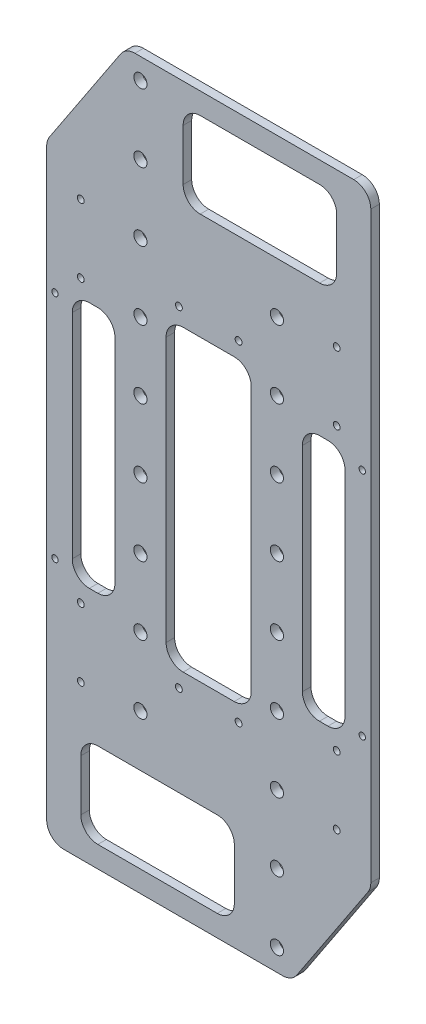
from build123d import *

# Parameters (mm, degrees)
SKETCH1_W                      = 114.3
SKETCH1_H                      = 63.5
SKETCH1_W_2                    = 63.363323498
SKETCH1_H_2                    = 222.25
SKETCH1_W_3                    = 31.75
SKETCH1_H_3                    = 184.15
BOSS_EXTRUDE1_DEPTH            = 6.35
SKETCH4_R                      = 4.9022
CUT_EXTRUDE2_DEPTH             = 592.266500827
F_1_4_20_TAPPED_HOLE1_D        = 5.1054
FILLET1_R                      = 12.7
F_1_4_20_TAPPED_HOLE2_D        = 5.1054
F_3_16_0_1875_DIAMETER_HOLE1_D = 4.7625


with BuildPart() as part:
    # Sketch1 → Boss-Extrude1 (new body)
    with BuildSketch(Plane.XY):
        Polygon((0, 0), (0, 450.85), (58.8772, 539.75), (241.3, 539.75), (241.3, 88.9), (182.4228, 0), align=None)
        with Locations((158.75, 492.125)):
            Rectangle(SKETCH1_W, SKETCH1_H, mode=Mode.SUBTRACT)
        with Locations((82.55, 47.625)):
            Rectangle(SKETCH1_W, SKETCH1_H, mode=Mode.SUBTRACT)
        with Locations((120.581661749, 269.875)):
            Rectangle(SKETCH1_W_2, SKETCH1_H_2, mode=Mode.SUBTRACT)
        with Locations((206.238323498, 269.875)):
            Rectangle(SKETCH1_W_3, SKETCH1_H_3, mode=Mode.SUBTRACT)
        with Locations((34.925, 269.875)):
            Rectangle(SKETCH1_W_3, SKETCH1_H_3, mode=Mode.SUBTRACT)
    extrude(amount=BOSS_EXTRUDE1_DEPTH)

    # Sketch4 → Cut-Extrude2 (cut, through all)
    with BuildSketch(Plane.XY):
        with Locations((69.781661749, 524.1544)):
            Circle(SKETCH4_R)
        with Locations((171.381661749, 422.5544)):
            Circle(SKETCH4_R)
        with Locations((171.381661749, 371.7544)):
            Circle(SKETCH4_R)
        with Locations((171.381661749, 320.9544)):
            Circle(SKETCH4_R)
        with Locations((171.381661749, 270.1544)):
            Circle(SKETCH4_R)
        with Locations((171.381661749, 219.3544)):
            Circle(SKETCH4_R)
        with Locations((171.381661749, 168.5544)):
            Circle(SKETCH4_R)
        with Locations((171.381661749, 117.7544)):
            Circle(SKETCH4_R)
        with Locations((171.381661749, 66.9544)):
            Circle(SKETCH4_R)
        with Locations((171.381661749, 16.1544)):
            Circle(SKETCH4_R)
        with Locations((69.781661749, 473.3544)):
            Circle(SKETCH4_R)
        with Locations((69.781661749, 422.5544)):
            Circle(SKETCH4_R)
        with Locations((69.781661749, 371.7544)):
            Circle(SKETCH4_R)
        with Locations((69.781661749, 320.9544)):
            Circle(SKETCH4_R)
        with Locations((69.781661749, 270.1544)):
            Circle(SKETCH4_R)
        with Locations((69.781661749, 219.3544)):
            Circle(SKETCH4_R)
        with Locations((69.781661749, 168.5544)):
            Circle(SKETCH4_R)
        with Locations((69.781661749, 117.7544)):
            Circle(SKETCH4_R)
    extrude(amount=CUT_EXTRUDE2_DEPTH, mode=Mode.SUBTRACT)

    # 1_4-20 Tapped Hole1 (through all)
    with Locations(Plane.XY.offset(6.35)):
        with Locations((98.425, 146.84375), (142.875, 146.84375), (98.425, 392.90625), (142.875, 392.90625)):
            Hole(F_1_4_20_TAPPED_HOLE1_D / 2)

    # Fillet1
    fillet1_edges = [part.edges().sort_by_distance(p)[0] for p in [
        (0, 0, 3.175),
        (0, 450.85, 3.175),
        (58.8772, 539.75, 3.175),
        (241.3, 539.75, 3.175),
        (241.3, 88.9, 3.175),
        (182.4228, 0, 3.175),
        (25.4, 79.375, 3.175),
        (25.4, 15.875, 3.175),
        (139.7, 15.875, 3.175),
        (139.7, 79.375, 3.175),
        (101.6, 523.875, 3.175),
        (101.6, 460.375, 3.175),
        (215.9, 460.375, 3.175),
        (215.9, 523.875, 3.175),
        (88.9, 158.75, 3.175),
        (152.263323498, 158.75, 3.175),
        (152.263323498, 381, 3.175),
        (88.9, 381, 3.175),
        (190.363323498, 361.95, 3.175),
        (190.363323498, 177.8, 3.175),
        (222.113323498, 177.8, 3.175),
        (222.113323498, 361.95, 3.175),
        (50.8, 177.8, 3.175),
        (50.8, 361.95, 3.175),
        (19.05, 361.95, 3.175),
        (19.05, 177.8, 3.175),
    ]]
    fillet(fillet1_edges, radius=FILLET1_R)

    # 1_4-20 Tapped Hole2 (through all)
    with Locations(Plane.XY.offset(6.35)):
        with Locations((25.4, 425.45), (25.4, 374.65), (215.9, 374.65), (215.9, 425.45), (215.9, 165.1381), (215.9, 114.3381), (25.4, 114.3), (25.4, 165.1)):
            Hole(F_1_4_20_TAPPED_HOLE2_D / 2)

    # 3_16 _0.1875_ Diameter Hole1 (through all)
    with Locations(Plane.XY.offset(6.35)):
        with Locations((234.95, 184.15), (234.95, 355.6), (6.213323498, 355.6), (6.213323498, 184.15)):
            Hole(F_3_16_0_1875_DIAMETER_HOLE1_D / 2)


solid = part.part
